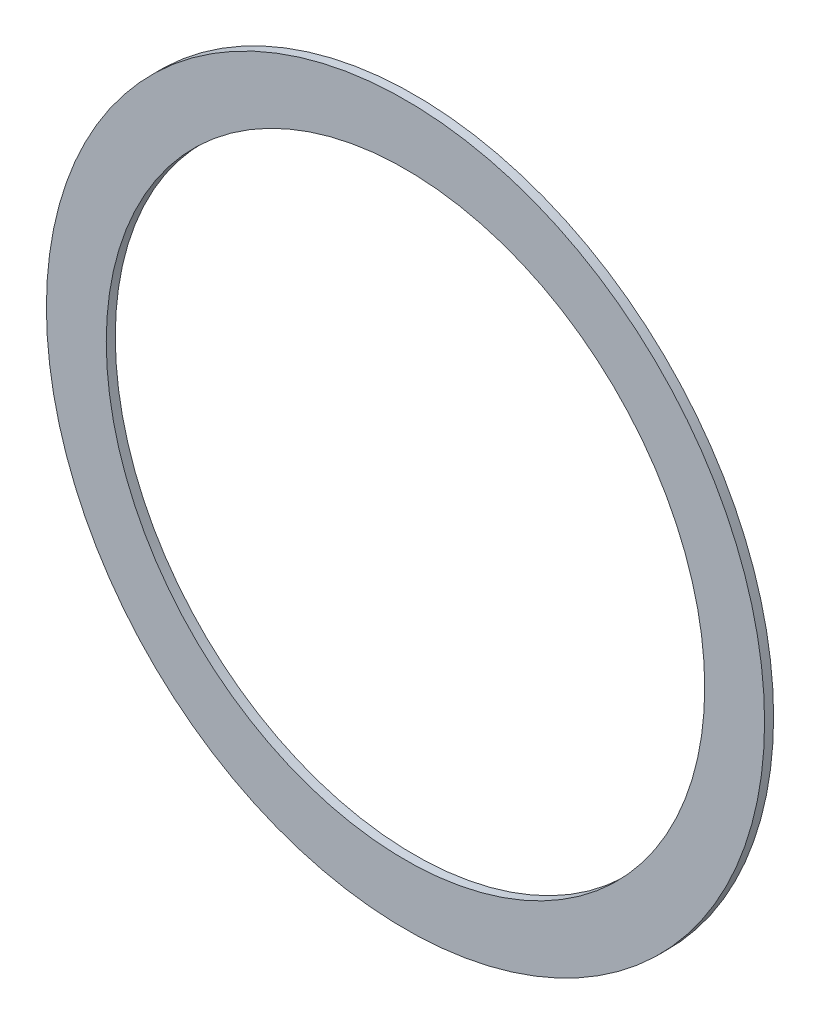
from build123d import *

# Parameters (mm, degrees)
SKETCH1_R      = 12.6492
SKETCH1_R_2    = 10.541
EXTRUDE1_DEPTH = 0.3175


with BuildPart() as part:
    # Sketch1 → Extrude1 (new body)
    with BuildSketch(Plane.XY):
        Circle(SKETCH1_R)
        Circle(SKETCH1_R_2, mode=Mode.SUBTRACT)
    extrude(amount=EXTRUDE1_DEPTH)


solid = part.part
